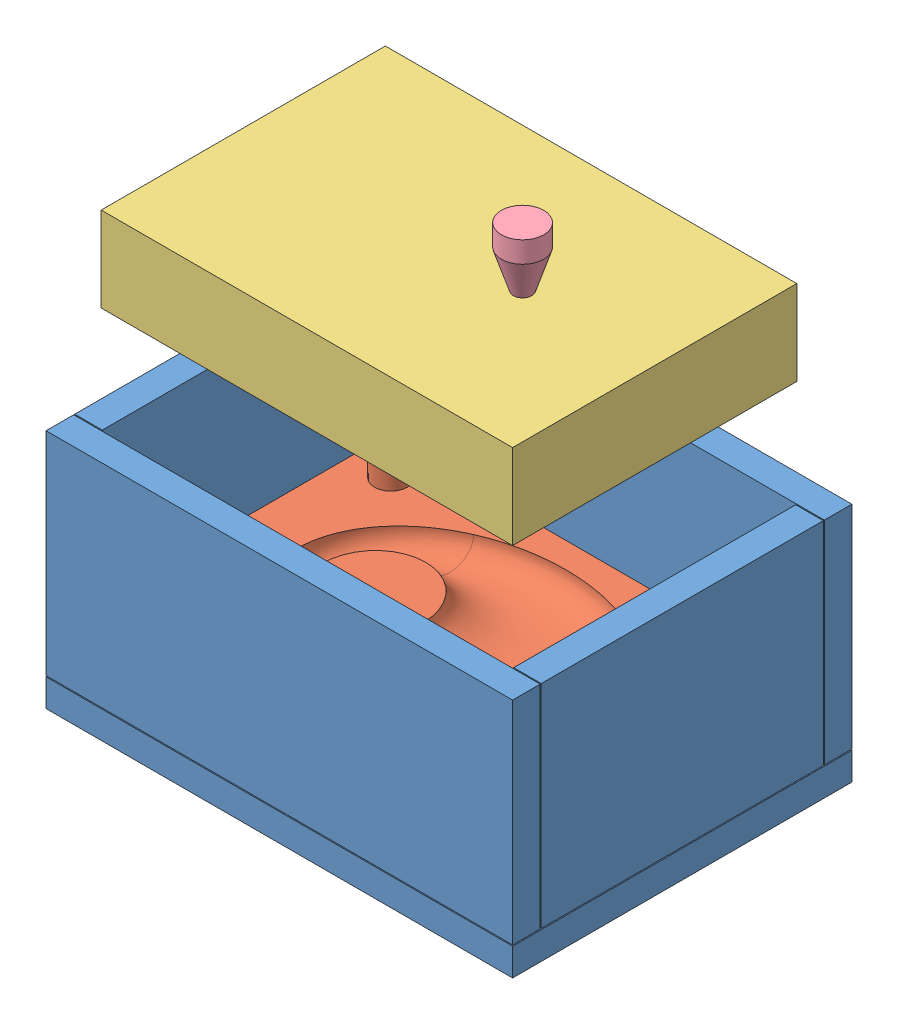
SolidWorks assembly MoldSetup.SLDASM, configuration Default (file format 11000). Lengths in mm.
Overall size (220 231.34 160).
5 component instances, 5 part files, 9 mates.
Components (placement in the parent):
- Sbox2-1: Sbox2.SLDPRT [Default] at origin size (220 113.5 160)
- DonutMoldA-1: DonutMoldA.SLDPRT [Default] at (0 44.27 0) size (194 42 134)
- DonutMoldB-1: DonutMoldB.SLDPRT [Default] at (0 163.6049 0) size (194 40 134)
- Donut-1: Donut.SLDPRT [Default] at (0 44.27 0) size (144 27.59 110.24)
- Funnel-1: Funnel.SLDPRT [Default] at (35.1735 196.3386 0.4833) size (20 55 20)
Mates (geometry in assembly coordinates):
- Parallel1: parallel: plane of Sbox2-1 through (0 13 0) normal (0 1 0); plane of DonutMoldA-1 through (0 14.27 0) normal (0 -1 0)
- Coincident2: coincident: plane of Sbox2-1 through (-97 247.1338 -66.5) normal (1 0 0); plane of DonutMoldA-1 through (-97 14.27 67) normal (-1 0 0)
- Coincident1: coincident: plane of Sbox2-1 through (97 247.1338 -66.5) normal (-1 0 0); plane of DonutMoldA-1 through (97 14.27 67) normal (1 0 0)
- Coincident3: coincident: plane of Sbox2-1 through (-110 113.5 67) normal (0 0 -1); plane of DonutMoldA-1 through (-97 14.27 67) normal (0 0 1)
- LimitDistance1: limit distance = 1.27 mm: plane of DonutMoldA-1 through (0 14.27 0) normal (0 -1 0); plane of Sbox2-1 through (0 13 0) normal (0 1 0)
- Coincident5: coincident: plane of Sbox2-1 through (-97 247.1338 -66.5) normal (1 0 0); plane of DonutMoldB-1 through (-97 203.6049 -67) normal (-1 0 0)
- Coincident6: coincident: plane of Sbox2-1 through (-110 113.5 67) normal (0 0 -1); plane of DonutMoldB-1 through (-97 203.6049 67) normal (0 0 1)
- LimitDistance2: limit distance = 119.3349 mm: plane of DonutMoldB-1 through (0 163.6049 0) normal (0 -1 0); plane of DonutMoldA-1 through (0 44.27 0) normal (0 1 0)
- Coincident9: coincident: point of DonutMoldA-1; point of Donut-1
